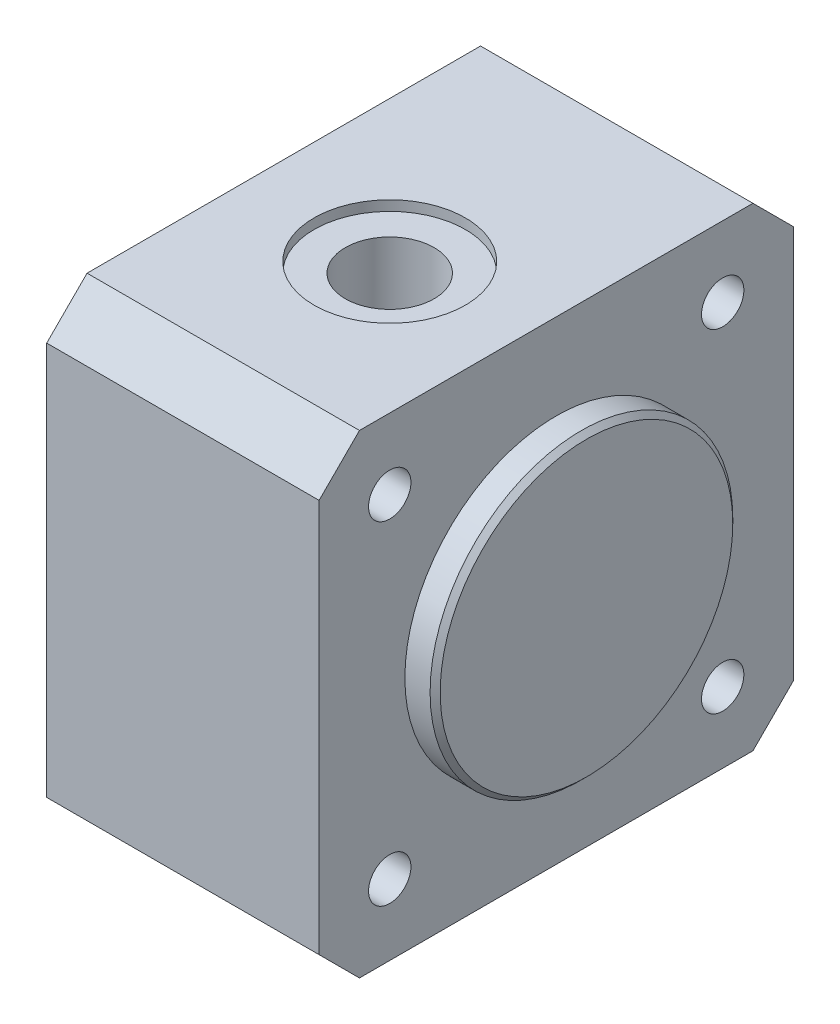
ISO-10303-21;
HEADER;
FILE_DESCRIPTION(('STEP AP214'),'2;1');
FILE_NAME('part.step','',(''),(''),'','','');
FILE_SCHEMA(('AUTOMOTIVE_DESIGN { 1 0 10303 214 1 1 1 1 }'));
ENDSEC;
DATA;
#1=APPLICATION_CONTEXT('core data for automotive mechanical design processes');
#2=APPLICATION_PROTOCOL_DEFINITION('international standard','automotive_design',2000,#1);
#3=PRODUCT_CONTEXT('',#1,'mechanical');
#4=PRODUCT('Part','Part','',(#3));
#5=PRODUCT_RELATED_PRODUCT_CATEGORY('part','',(#4));
#6=PRODUCT_DEFINITION_FORMATION('','',#4);
#7=PRODUCT_DEFINITION_CONTEXT('part definition',#1,'design');
#8=PRODUCT_DEFINITION('design','',#6,#7);
#9=PRODUCT_DEFINITION_SHAPE('','',#8);
#10=(LENGTH_UNIT() NAMED_UNIT(*) SI_UNIT(.MILLI.,.METRE.));
#11=(NAMED_UNIT(*) PLANE_ANGLE_UNIT() SI_UNIT($,.RADIAN.));
#12=(NAMED_UNIT(*) SI_UNIT($,.STERADIAN.) SOLID_ANGLE_UNIT());
#13=UNCERTAINTY_MEASURE_WITH_UNIT(LENGTH_MEASURE(1.E-05),#10,'distance_accuracy_value','');
#14=(GEOMETRIC_REPRESENTATION_CONTEXT(3) GLOBAL_UNCERTAINTY_ASSIGNED_CONTEXT((#13)) GLOBAL_UNIT_ASSIGNED_CONTEXT((#10,
#11,#12)) REPRESENTATION_CONTEXT('',''));
#15=CARTESIAN_POINT('',(0.,0.,0.));
#16=DIRECTION('',(0.,0.,1.));
#17=DIRECTION('',(1.,0.,0.));
#18=AXIS2_PLACEMENT_3D('',#15,#16,#17);
#19=CARTESIAN_POINT('',(14.,47.,-20.));
#20=DIRECTION('',(0.,1.,0.));
#21=DIRECTION('',(0.,0.,1.));
#22=AXIS2_PLACEMENT_3D('',#19,#20,#21);
#23=CYLINDRICAL_SURFACE('',#22,4.39999999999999);
#24=CARTESIAN_POINT('',(14.,23.5,-20.));
#25=DIRECTION('',(0.,1.,0.));
#26=DIRECTION('',(0.,0.,1.));
#27=AXIS2_PLACEMENT_3D('',#24,#25,#26);
#28=CIRCLE('',#27,4.4);
#29=CARTESIAN_POINT('',(12.1669697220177,23.5,-16.));
#30=VERTEX_POINT('',#29);
#31=CARTESIAN_POINT('',(15.8330302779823,23.5,-16.));
#32=VERTEX_POINT('',#31);
#33=EDGE_CURVE('E59',#30,#32,#28,.T.);
#34=ORIENTED_EDGE('',*,*,#33,.F.);
#35=CARTESIAN_POINT('',(15.8330302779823,23.5,-16.));
#36=CARTESIAN_POINT('',(15.8330136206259,23.5649652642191,-15.9999975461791));
#37=CARTESIAN_POINT('',(15.8348737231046,23.6299119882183,-16.0008443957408));
#38=CARTESIAN_POINT('',(15.8422002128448,23.7595219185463,-16.0042117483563));
#39=CARTESIAN_POINT('',(15.8476645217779,23.8241852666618,-16.0067312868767));
#40=CARTESIAN_POINT('',(15.8691678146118,24.0167886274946,-16.0167264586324));
#41=CARTESIAN_POINT('',(15.8903203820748,24.1440566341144,-16.0266392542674));
#42=CARTESIAN_POINT('',(15.9434320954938,24.393334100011,-16.0523543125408));
#43=CARTESIAN_POINT('',(15.9752038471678,24.5153959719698,-16.0680549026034));
#44=CARTESIAN_POINT('',(16.0470431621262,24.7563497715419,-16.1049706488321));
#45=CARTESIAN_POINT('',(16.0871235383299,24.8752364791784,-16.1261943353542));
#46=CARTESIAN_POINT('',(16.202132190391,25.1886952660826,-16.1898398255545));
#47=CARTESIAN_POINT('',(16.2823605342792,25.3803607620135,-16.236915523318));
#48=CARTESIAN_POINT('',(16.4512273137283,25.7559170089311,-16.344651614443));
#49=CARTESIAN_POINT('',(16.5398693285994,25.9398044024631,-16.4053178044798));
#50=CARTESIAN_POINT('',(16.7215113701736,26.3030156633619,-16.5407559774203));
#51=CARTESIAN_POINT('',(16.8145498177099,26.4822626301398,-16.6156822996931));
#52=CARTESIAN_POINT('',(17.0003191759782,26.8344890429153,-16.7792212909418));
#53=CARTESIAN_POINT('',(17.0930501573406,27.0074700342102,-16.8678305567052));
#54=CARTESIAN_POINT('',(17.284177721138,27.3637132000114,-17.0682492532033));
#55=CARTESIAN_POINT('',(17.3822569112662,27.5463555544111,-17.1814726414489));
#56=CARTESIAN_POINT('',(17.5712935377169,27.9037969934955,-17.4251855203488));
#57=CARTESIAN_POINT('',(17.6622486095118,28.0785934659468,-17.5556807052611));
#58=CARTESIAN_POINT('',(17.8330855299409,28.4181475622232,-17.8334660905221));
#59=CARTESIAN_POINT('',(17.9130315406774,28.5829599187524,-17.9806489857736));
#60=CARTESIAN_POINT('',(18.0587626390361,28.9018653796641,-18.2923552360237));
#61=CARTESIAN_POINT('',(18.1245603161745,29.0559679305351,-18.4568629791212));
#62=CARTESIAN_POINT('',(18.2465112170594,29.3737736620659,-18.8291204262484));
#63=CARTESIAN_POINT('',(18.2997265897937,29.5354362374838,-19.0396527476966));
#64=CARTESIAN_POINT('',(18.3561363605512,29.7620261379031,-19.3702328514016));
#65=CARTESIAN_POINT('',(18.3710388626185,29.8349353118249,-19.4829450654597));
#66=CARTESIAN_POINT('',(18.392123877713,29.9749094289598,-19.7127050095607));
#67=CARTESIAN_POINT('',(18.398310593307,30.0419771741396,-19.8297506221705));
#68=CARTESIAN_POINT('',(18.4011022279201,30.1703799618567,-20.068586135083));
#69=CARTESIAN_POINT('',(18.3976106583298,30.2316509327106,-20.1904117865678));
#70=CARTESIAN_POINT('',(18.3800223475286,30.3471993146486,-20.4366119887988));
#71=CARTESIAN_POINT('',(18.3659255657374,30.4014766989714,-20.5609865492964));
#72=CARTESIAN_POINT('',(18.3264876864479,30.5026177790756,-20.8108559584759));
#73=CARTESIAN_POINT('',(18.3011557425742,30.5494874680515,-20.9363498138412));
#74=CARTESIAN_POINT('',(18.2388237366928,30.6356665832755,-21.1870320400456));
#75=CARTESIAN_POINT('',(18.2018255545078,30.674977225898,-21.3122204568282));
#76=CARTESIAN_POINT('',(18.1219184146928,30.7411921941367,-21.543582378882));
#77=CARTESIAN_POINT('',(18.0805197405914,30.7690589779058,-21.6500054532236));
#78=CARTESIAN_POINT('',(17.9890126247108,30.8193759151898,-21.8603574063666));
#79=CARTESIAN_POINT('',(17.9389046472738,30.841826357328,-21.9642864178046));
#80=CARTESIAN_POINT('',(17.8302089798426,30.8816156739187,-22.1686149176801));
#81=CARTESIAN_POINT('',(17.7716218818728,30.8989549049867,-22.269014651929));
#82=CARTESIAN_POINT('',(17.6463222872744,30.928952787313,-22.4653389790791));
#83=CARTESIAN_POINT('',(17.5796097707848,30.9416114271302,-22.5612635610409));
#84=CARTESIAN_POINT('',(17.4422417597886,30.962213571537,-22.7428517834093));
#85=CARTESIAN_POINT('',(17.3719805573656,30.9703707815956,-22.8287897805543));
#86=CARTESIAN_POINT('',(17.2250275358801,30.9834623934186,-22.9952538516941));
#87=CARTESIAN_POINT('',(17.148333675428,30.9883957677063,-23.0757781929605));
#88=CARTESIAN_POINT('',(16.9093477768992,30.9991543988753,-23.3083212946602));
#89=CARTESIAN_POINT('',(16.7380438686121,31.0009524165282,-23.451452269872));
#90=CARTESIAN_POINT('',(16.3652576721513,30.9980962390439,-23.7176827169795));
#91=CARTESIAN_POINT('',(16.1625928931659,30.9930562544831,-23.8391084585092));
#92=CARTESIAN_POINT('',(15.7403551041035,30.9806867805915,-24.0480327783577));
#93=CARTESIAN_POINT('',(15.5207780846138,30.9733567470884,-24.1355232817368));
#94=CARTESIAN_POINT('',(15.1778776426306,30.9633695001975,-24.2412127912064));
#95=CARTESIAN_POINT('',(15.0584687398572,30.9601484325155,-24.2725737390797));
#96=CARTESIAN_POINT('',(14.817432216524,30.9545172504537,-24.3251582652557));
#97=CARTESIAN_POINT('',(14.6958053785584,30.9521068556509,-24.3463853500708));
#98=CARTESIAN_POINT('',(14.4511487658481,30.9483830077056,-24.3785499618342));
#99=CARTESIAN_POINT('',(14.3281185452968,30.9470699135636,-24.3894841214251));
#100=CARTESIAN_POINT('',(14.081611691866,30.9456889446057,-24.4009721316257));
#101=CARTESIAN_POINT('',(13.9581352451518,30.945620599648,-24.401529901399));
#102=CARTESIAN_POINT('',(13.7117721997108,30.9467350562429,-24.3922769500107));
#103=CARTESIAN_POINT('',(13.5888849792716,30.9479158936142,-24.3824825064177));
#104=CARTESIAN_POINT('',(13.3444253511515,30.9513924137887,-24.3526290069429));
#105=CARTESIAN_POINT('',(13.2228524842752,30.9536876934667,-24.332573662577));
#106=CARTESIAN_POINT('',(12.9817749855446,30.9591280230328,-24.2823342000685));
#107=CARTESIAN_POINT('',(12.8622714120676,30.9622734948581,-24.2521450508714));
#108=CARTESIAN_POINT('',(12.6262723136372,30.9690226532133,-24.1818686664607));
#109=CARTESIAN_POINT('',(12.509775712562,30.9726261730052,-24.1417850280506));
#110=CARTESIAN_POINT('',(12.2802966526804,30.9798027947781,-24.0518933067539));
#111=CARTESIAN_POINT('',(12.1673225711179,30.9833758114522,-24.0020638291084));
#112=CARTESIAN_POINT('',(11.9459870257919,30.9898896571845,-23.8931016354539));
#113=CARTESIAN_POINT('',(11.8376238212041,30.9928307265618,-23.8339724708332));
#114=CARTESIAN_POINT('',(11.6261740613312,30.9974191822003,-23.7067748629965));
#115=CARTESIAN_POINT('',(11.523090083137,30.9990659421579,-23.6387021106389));
#116=CARTESIAN_POINT('',(11.3230396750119,31.0003456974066,-23.4941529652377));
#117=CARTESIAN_POINT('',(11.2260707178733,30.9999795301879,-23.4176800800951));
#118=CARTESIAN_POINT('',(11.0392420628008,30.9964955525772,-23.2571504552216));
#119=CARTESIAN_POINT('',(10.9493595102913,30.9933870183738,-23.1731201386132));
#120=CARTESIAN_POINT('',(10.7770679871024,30.9836921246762,-22.9979646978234));
#121=CARTESIAN_POINT('',(10.6946558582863,30.9771072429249,-22.9068426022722));
#122=CARTESIAN_POINT('',(10.5379344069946,30.9597515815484,-22.7182943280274));
#123=CARTESIAN_POINT('',(10.4636223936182,30.9489821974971,-22.6208702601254));
#124=CARTESIAN_POINT('',(10.3236489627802,30.9226084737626,-22.4206122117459));
#125=CARTESIAN_POINT('',(10.2579869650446,30.9070044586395,-22.3177785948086));
#126=CARTESIAN_POINT('',(10.1393909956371,30.8714935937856,-22.1139467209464));
#127=CARTESIAN_POINT('',(10.0859345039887,30.8518950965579,-22.0131984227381));
#128=CARTESIAN_POINT('',(9.98737407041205,30.8075801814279,-21.8087857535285));
#129=CARTESIAN_POINT('',(9.94226977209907,30.7828639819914,-21.7051215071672));
#130=CARTESIAN_POINT('',(9.86056975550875,30.7280900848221,-21.4959033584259));
#131=CARTESIAN_POINT('',(9.82397189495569,30.6980337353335,-21.3903499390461));
#132=CARTESIAN_POINT('',(9.75926872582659,30.6324749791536,-21.178338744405));
#133=CARTESIAN_POINT('',(9.7311633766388,30.5969725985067,-21.0718809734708));
#134=CARTESIAN_POINT('',(9.68426532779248,30.5221006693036,-20.8633593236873));
#135=CARTESIAN_POINT('',(9.66514133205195,30.4829461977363,-20.761292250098));
#136=CARTESIAN_POINT('',(9.63431339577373,30.3997578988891,-20.5579923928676));
#137=CARTESIAN_POINT('',(9.62261216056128,30.3557222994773,-20.4567599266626));
#138=CARTESIAN_POINT('',(9.60629083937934,30.2629824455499,-20.2558812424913));
#139=CARTESIAN_POINT('',(9.60167084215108,30.2142781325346,-20.1562350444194));
#140=CARTESIAN_POINT('',(9.59908538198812,30.1124541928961,-19.9591294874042));
#141=CARTESIAN_POINT('',(9.60112122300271,30.0593337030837,-19.8616705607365));
#142=CARTESIAN_POINT('',(9.61305007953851,29.9309853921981,-19.6381359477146));
#143=CARTESIAN_POINT('',(9.62528601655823,29.8541918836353,-19.5130772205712));
#144=CARTESIAN_POINT('',(9.6594567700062,29.6940867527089,-19.2686076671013));
#145=CARTESIAN_POINT('',(9.68139416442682,29.6107734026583,-19.1491983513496));
#146=CARTESIAN_POINT('',(9.76004506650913,29.3519243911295,-18.8001243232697));
#147=CARTESIAN_POINT('',(9.82958452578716,29.1675839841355,-18.5797935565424));
#148=CARTESIAN_POINT('',(10.0251250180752,28.7073387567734,-18.0883292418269));
#149=CARTESIAN_POINT('',(10.1625349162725,28.4231926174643,-17.8295483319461));
#150=CARTESIAN_POINT('',(10.3900667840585,27.9779141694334,-17.4805268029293));
#151=CARTESIAN_POINT('',(10.4696132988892,27.826073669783,-17.3705783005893));
#152=CARTESIAN_POINT('',(10.6337973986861,27.5165321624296,-17.1634308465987));
#153=CARTESIAN_POINT('',(10.7184340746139,27.3588322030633,-17.066229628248));
#154=CARTESIAN_POINT('',(10.8939256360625,27.0317582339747,-16.8808310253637));
#155=CARTESIAN_POINT('',(10.9848944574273,26.8621685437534,-16.7931250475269));
#156=CARTESIAN_POINT('',(11.1673194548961,26.51693834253,-16.6309037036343));
#157=CARTESIAN_POINT('',(11.2587758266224,26.341295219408,-16.5563941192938));
#158=CARTESIAN_POINT('',(11.4386598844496,25.9836372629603,-16.4205857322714));
#159=CARTESIAN_POINT('',(11.5270900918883,25.8016280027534,-16.3592756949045));
#160=CARTESIAN_POINT('',(11.696075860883,25.430263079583,-16.2500642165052));
#161=CARTESIAN_POINT('',(11.776638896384,25.2409146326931,-16.2021499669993));
#162=CARTESIAN_POINT('',(11.9260107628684,24.8438926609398,-16.1184753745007));
#163=CARTESIAN_POINT('',(11.9940865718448,24.6357760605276,-16.0833943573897));
#164=CARTESIAN_POINT('',(12.0738943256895,24.3169561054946,-16.0438634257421));
#165=CARTESIAN_POINT('',(12.0967493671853,24.2098545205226,-16.0328796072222));
#166=CARTESIAN_POINT('',(12.1334273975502,23.9937798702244,-16.0154895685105));
#167=CARTESIAN_POINT('',(12.1472589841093,23.8848086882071,-16.0090789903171));
#168=CARTESIAN_POINT('',(12.159616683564,23.7296361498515,-16.0033761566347));
#169=CARTESIAN_POINT('',(12.1623655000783,23.6838132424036,-16.0021124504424));
#170=CARTESIAN_POINT('',(12.1660451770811,23.5919963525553,-16.0004234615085));
#171=CARTESIAN_POINT('',(12.1669727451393,23.5460022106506,-15.9999996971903));
#172=CARTESIAN_POINT('',(12.1669697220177,23.5,-16.));
#173=B_SPLINE_CURVE_WITH_KNOTS('',3,(#35,#36,#37,#38,#39,#40,#41,#42,#43,#44,#45,#46,#47,#48,
#49,#50,#51,#52,#53,#54,#55,#56,#57,#58,#59,#60,#61,#62,#63,#64,#65,#66,#67,#68,#69,#70,#71,#72,
#73,#74,#75,#76,#77,#78,#79,#80,#81,#82,#83,#84,#85,#86,#87,#88,#89,#90,#91,#92,#93,#94,#95,#96,
#97,#98,#99,#100,#101,#102,#103,#104,#105,#106,#107,#108,#109,#110,#111,#112,#113,#114,#115,
#116,#117,#118,#119,#120,#121,#122,#123,#124,#125,#126,#127,#128,#129,#130,#131,#132,#133,#134,
#135,#136,#137,#138,#139,#140,#141,#142,#143,#144,#145,#146,#147,#148,#149,#150,#151,#152,#153,
#154,#155,#156,#157,#158,#159,#160,#161,#162,#163,#164,#165,#166,#167,#168,#169,#170,#171,#172),
.UNSPECIFIED.,.F.,.F.,(4,2,2,2,2,2,2,2,2,2,2,2,2,2,2,2,2,2,2,2,2,2,2,2,2,2,2,2,2,2,2,2,2,2,2,2,
2,2,2,2,2,2,2,2,2,2,2,2,2,2,2,2,2,2,2,2,2,2,2,2,2,2,2,2,2,2,2,2,4),(0.,0.194829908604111,
0.389547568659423,0.776853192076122,1.15765632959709,1.53905114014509,2.1771047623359,
2.81543104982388,3.46110541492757,4.10661944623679,4.8144566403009,5.52252778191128,
6.22627969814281,6.92940278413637,7.738251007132,8.14304762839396,8.54764899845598,
8.95629854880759,9.36494966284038,9.77326844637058,10.1815214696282,10.5336890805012,
10.8858379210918,11.2379621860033,11.5900873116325,11.9236164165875,12.257251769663,
12.9239921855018,13.6299552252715,14.3360861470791,14.7062218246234,15.0762293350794,
15.4463578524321,15.8163465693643,16.1857543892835,16.5550286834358,16.9244865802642,
17.2938103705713,17.6639542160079,18.0339570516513,18.4041388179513,18.7741665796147,
19.1429474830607,19.5115717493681,19.8800731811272,20.248549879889,20.595276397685,
20.9419881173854,21.2886124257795,21.6352350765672,21.9678080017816,22.300502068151,
22.633200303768,22.9659637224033,23.4070981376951,23.8483498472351,24.7314703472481,
25.9489768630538,26.5595317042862,27.1699778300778,27.803951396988,28.4382020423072,
29.0719106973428,29.7050113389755,30.3679531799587,30.6977597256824,31.0272515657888,
31.1649825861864,31.3029623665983),.UNSPECIFIED.);
#174=EDGE_CURVE('E11',#32,#30,#173,.T.);
#175=ORIENTED_EDGE('',*,*,#174,.F.);
#176=EDGE_LOOP('',(#34,#175));
#177=FACE_BOUND('',#176,.T.);
#178=CARTESIAN_POINT('',(14.,46.,-20.));
#179=DIRECTION('',(0.,1.,0.));
#180=DIRECTION('',(0.,0.,1.));
#181=AXIS2_PLACEMENT_3D('',#178,#179,#180);
#182=CIRCLE('',#181,4.39999999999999);
#183=CARTESIAN_POINT('',(14.,46.,-15.6));
#184=VERTEX_POINT('',#183);
#185=EDGE_CURVE('E48',#184,#184,#182,.F.);
#186=ORIENTED_EDGE('',*,*,#185,.F.);
#187=EDGE_LOOP('',(#186));
#188=FACE_BOUND('',#187,.T.);
#189=ADVANCED_FACE('F44',(#177,#188),#23,.F.);
#190=CARTESIAN_POINT('',(-7.,23.5,-23.5));
#191=DIRECTION('',(1.,0.,0.));
#192=DIRECTION('',(0.,0.,-1.));
#193=AXIS2_PLACEMENT_3D('',#190,#191,#192);
#194=CYLINDRICAL_SURFACE('',#193,16.5);
#195=CARTESIAN_POINT('',(0.,23.5,-23.5));
#196=DIRECTION('',(-1.,0.,0.));
#197=DIRECTION('',(0.,0.,1.));
#198=AXIS2_PLACEMENT_3D('',#195,#196,#197);
#199=CIRCLE('',#198,16.5);
#200=CARTESIAN_POINT('',(0.,23.5,-7.));
#201=VERTEX_POINT('',#200);
#202=EDGE_CURVE('E146',#201,#201,#199,.T.);
#203=ORIENTED_EDGE('',*,*,#202,.T.);
#204=EDGE_LOOP('',(#203));
#205=FACE_BOUND('',#204,.T.);
#206=CARTESIAN_POINT('',(-2.39222561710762,23.5,-23.5));
#207=DIRECTION('',(-1.,0.,0.));
#208=DIRECTION('',(0.,0.,1.));
#209=AXIS2_PLACEMENT_3D('',#206,#207,#208);
#210=CIRCLE('',#209,16.5);
#211=CARTESIAN_POINT('',(-2.39222561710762,23.5,-7.));
#212=VERTEX_POINT('',#211);
#213=EDGE_CURVE('E149',#212,#212,#210,.T.);
#214=ORIENTED_EDGE('',*,*,#213,.F.);
#215=EDGE_LOOP('',(#214));
#216=FACE_BOUND('',#215,.T.);
#217=ADVANCED_FACE('F256',(#205,#216),#194,.T.);
#218=CARTESIAN_POINT('',(0.,47.,0.));
#219=DIRECTION('',(-1.,0.,0.));
#220=DIRECTION('',(0.,0.,1.));
#221=AXIS2_PLACEMENT_3D('',#218,#219,#220);
#222=PLANE('',#221);
#223=CARTESIAN_POINT('',(0.,40.,-40.));
#224=DIRECTION('',(1.,0.,0.));
#225=DIRECTION('',(0.,0.,-1.));
#226=AXIS2_PLACEMENT_3D('',#223,#224,#225);
#227=CIRCLE('',#226,2.09999999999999);
#228=CARTESIAN_POINT('',(0.,40.,-42.1));
#229=VERTEX_POINT('',#228);
#230=EDGE_CURVE('E224',#229,#229,#227,.T.);
#231=ORIENTED_EDGE('',*,*,#230,.T.);
#232=EDGE_LOOP('',(#231));
#233=FACE_BOUND('',#232,.T.);
#234=CARTESIAN_POINT('',(0.,40.,-6.99999999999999));
#235=DIRECTION('',(1.,0.,0.));
#236=DIRECTION('',(0.,0.,-1.));
#237=AXIS2_PLACEMENT_3D('',#234,#235,#236);
#238=CIRCLE('',#237,2.09999999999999);
#239=CARTESIAN_POINT('',(0.,40.,-9.09999999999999));
#240=VERTEX_POINT('',#239);
#241=EDGE_CURVE('E218',#240,#240,#238,.T.);
#242=ORIENTED_EDGE('',*,*,#241,.T.);
#243=EDGE_LOOP('',(#242));
#244=FACE_BOUND('',#243,.T.);
#245=CARTESIAN_POINT('',(0.,7.,-7.));
#246=DIRECTION('',(1.,0.,0.));
#247=DIRECTION('',(0.,0.,-1.));
#248=AXIS2_PLACEMENT_3D('',#245,#246,#247);
#249=CIRCLE('',#248,2.09999999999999);
#250=CARTESIAN_POINT('',(0.,7.,-9.09999999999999));
#251=VERTEX_POINT('',#250);
#252=EDGE_CURVE('E155',#251,#251,#249,.T.);
#253=ORIENTED_EDGE('',*,*,#252,.T.);
#254=EDGE_LOOP('',(#253));
#255=FACE_BOUND('',#254,.T.);
#256=DIRECTION('',(0.,1.,0.));
#257=VECTOR('',#256,1.);
#258=CARTESIAN_POINT('',(0.,0.,-47.));
#259=LINE('',#258,#257);
#260=CARTESIAN_POINT('',(0.,4.00000000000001,-47.));
#261=VERTEX_POINT('',#260);
#262=CARTESIAN_POINT('',(0.,43.,-47.));
#263=VERTEX_POINT('',#262);
#264=EDGE_CURVE('E180',#261,#263,#259,.T.);
#265=ORIENTED_EDGE('',*,*,#264,.F.);
#266=DIRECTION('',(0.,0.707106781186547,-0.707106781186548));
#267=VECTOR('',#266,1.);
#268=CARTESIAN_POINT('',(0.,1.99999999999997,-44.9999999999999));
#269=LINE('',#268,#267);
#270=CARTESIAN_POINT('',(0.,0.,-43.));
#271=VERTEX_POINT('',#270);
#272=EDGE_CURVE('E194',#261,#271,#269,.F.);
#273=ORIENTED_EDGE('',*,*,#272,.T.);
#274=DIRECTION('',(0.,0.,-1.));
#275=VECTOR('',#274,1.);
#276=CARTESIAN_POINT('',(0.,0.,0.));
#277=LINE('',#276,#275);
#278=CARTESIAN_POINT('',(0.,0.,-4.));
#279=VERTEX_POINT('',#278);
#280=EDGE_CURVE('E177',#279,#271,#277,.T.);
#281=ORIENTED_EDGE('',*,*,#280,.F.);
#282=DIRECTION('',(0.,-0.707106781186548,-0.707106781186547));
#283=VECTOR('',#282,1.);
#284=CARTESIAN_POINT('',(0.,25.5,21.5));
#285=LINE('',#284,#283);
#286=CARTESIAN_POINT('',(0.,4.00000000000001,0.));
#287=VERTEX_POINT('',#286);
#288=EDGE_CURVE('E192',#279,#287,#285,.F.);
#289=ORIENTED_EDGE('',*,*,#288,.T.);
#290=DIRECTION('',(0.,-1.,0.));
#291=VECTOR('',#290,1.);
#292=CARTESIAN_POINT('',(0.,0.,0.));
#293=LINE('',#292,#291);
#294=CARTESIAN_POINT('',(0.,43.,0.));
#295=VERTEX_POINT('',#294);
#296=EDGE_CURVE('E161',#295,#287,#293,.T.);
#297=ORIENTED_EDGE('',*,*,#296,.F.);
#298=DIRECTION('',(0.,-0.707106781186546,0.707106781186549));
#299=VECTOR('',#298,1.);
#300=CARTESIAN_POINT('',(0.,45.,-1.99999999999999));
#301=LINE('',#300,#299);
#302=CARTESIAN_POINT('',(0.,47.,-4.));
#303=VERTEX_POINT('',#302);
#304=EDGE_CURVE('E188',#295,#303,#301,.F.);
#305=ORIENTED_EDGE('',*,*,#304,.T.);
#306=DIRECTION('',(0.,0.,1.));
#307=VECTOR('',#306,1.);
#308=CARTESIAN_POINT('',(0.,47.,0.));
#309=LINE('',#308,#307);
#310=CARTESIAN_POINT('',(0.,47.,-43.));
#311=VERTEX_POINT('',#310);
#312=EDGE_CURVE('E166',#311,#303,#309,.T.);
#313=ORIENTED_EDGE('',*,*,#312,.F.);
#314=DIRECTION('',(0.,0.707106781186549,0.707106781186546));
#315=VECTOR('',#314,1.);
#316=CARTESIAN_POINT('',(0.,68.5,-21.5000000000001));
#317=LINE('',#316,#315);
#318=EDGE_CURVE('E190',#311,#263,#317,.F.);
#319=ORIENTED_EDGE('',*,*,#318,.T.);
#320=EDGE_LOOP('',(#265,#273,#281,#289,#297,#305,#313,#319));
#321=FACE_BOUND('',#320,.T.);
#322=CARTESIAN_POINT('',(0.,7.00000000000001,-40.));
#323=DIRECTION('',(1.,0.,0.));
#324=DIRECTION('',(0.,0.,-1.));
#325=AXIS2_PLACEMENT_3D('',#322,#323,#324);
#326=CIRCLE('',#325,2.09999999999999);
#327=CARTESIAN_POINT('',(0.,7.00000000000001,-42.1));
#328=VERTEX_POINT('',#327);
#329=EDGE_CURVE('E145',#328,#328,#326,.T.);
#330=ORIENTED_EDGE('',*,*,#329,.T.);
#331=EDGE_LOOP('',(#330));
#332=FACE_BOUND('',#331,.T.);
#333=ORIENTED_EDGE('',*,*,#202,.F.);
#334=EDGE_LOOP('',(#333));
#335=FACE_BOUND('',#334,.T.);
#336=ADVANCED_FACE('F259',(#233,#244,#255,#321,#332,#335),#222,.T.);
#337=CARTESIAN_POINT('',(27.,47.,0.));
#338=DIRECTION('',(-1.,0.,0.));
#339=DIRECTION('',(0.,0.,1.));
#340=AXIS2_PLACEMENT_3D('',#337,#338,#339);
#341=PLANE('',#340);
#342=CARTESIAN_POINT('',(27.,40.,-40.));
#343=DIRECTION('',(1.,0.,0.));
#344=DIRECTION('',(0.,0.,-1.));
#345=AXIS2_PLACEMENT_3D('',#342,#343,#344);
#346=CIRCLE('',#345,2.1);
#347=CARTESIAN_POINT('',(27.,40.,-42.1));
#348=VERTEX_POINT('',#347);
#349=EDGE_CURVE('E227',#348,#348,#346,.T.);
#350=ORIENTED_EDGE('',*,*,#349,.F.);
#351=EDGE_LOOP('',(#350));
#352=FACE_BOUND('',#351,.T.);
#353=CARTESIAN_POINT('',(27.,40.,-7.));
#354=DIRECTION('',(1.,0.,0.));
#355=DIRECTION('',(0.,0.,-1.));
#356=AXIS2_PLACEMENT_3D('',#353,#354,#355);
#357=CIRCLE('',#356,2.1);
#358=CARTESIAN_POINT('',(27.,40.,-9.1));
#359=VERTEX_POINT('',#358);
#360=EDGE_CURVE('E221',#359,#359,#357,.T.);
#361=ORIENTED_EDGE('',*,*,#360,.F.);
#362=EDGE_LOOP('',(#361));
#363=FACE_BOUND('',#362,.T.);
#364=DIRECTION('',(0.,0.,-1.));
#365=VECTOR('',#364,1.);
#366=CARTESIAN_POINT('',(27.,0.,0.));
#367=LINE('',#366,#365);
#368=CARTESIAN_POINT('',(27.,0.,-4.));
#369=VERTEX_POINT('',#368);
#370=CARTESIAN_POINT('',(27.,0.,-43.));
#371=VERTEX_POINT('',#370);
#372=EDGE_CURVE('E165',#369,#371,#367,.T.);
#373=ORIENTED_EDGE('',*,*,#372,.T.);
#374=DIRECTION('',(0.,-0.707106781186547,0.707106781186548));
#375=VECTOR('',#374,1.);
#376=CARTESIAN_POINT('',(27.,4.00000000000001,-47.));
#377=LINE('',#376,#375);
#378=CARTESIAN_POINT('',(27.,4.00000000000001,-47.));
#379=VERTEX_POINT('',#378);
#380=EDGE_CURVE('E207',#371,#379,#377,.F.);
#381=ORIENTED_EDGE('',*,*,#380,.T.);
#382=DIRECTION('',(0.,1.,0.));
#383=VECTOR('',#382,1.);
#384=CARTESIAN_POINT('',(27.,0.,-47.));
#385=LINE('',#384,#383);
#386=CARTESIAN_POINT('',(27.,43.,-47.));
#387=VERTEX_POINT('',#386);
#388=EDGE_CURVE('E169',#379,#387,#385,.T.);
#389=ORIENTED_EDGE('',*,*,#388,.T.);
#390=DIRECTION('',(0.,-0.707106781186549,-0.707106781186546));
#391=VECTOR('',#390,1.);
#392=CARTESIAN_POINT('',(27.,47.,-43.));
#393=LINE('',#392,#391);
#394=CARTESIAN_POINT('',(27.,47.,-43.));
#395=VERTEX_POINT('',#394);
#396=EDGE_CURVE('E203',#387,#395,#393,.F.);
#397=ORIENTED_EDGE('',*,*,#396,.T.);
#398=DIRECTION('',(0.,0.,1.));
#399=VECTOR('',#398,1.);
#400=CARTESIAN_POINT('',(27.,47.,0.));
#401=LINE('',#400,#399);
#402=CARTESIAN_POINT('',(27.,47.,-4.));
#403=VERTEX_POINT('',#402);
#404=EDGE_CURVE('E172',#395,#403,#401,.T.);
#405=ORIENTED_EDGE('',*,*,#404,.T.);
#406=DIRECTION('',(0.,0.707106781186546,-0.707106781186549));
#407=VECTOR('',#406,1.);
#408=CARTESIAN_POINT('',(27.,43.,0.));
#409=LINE('',#408,#407);
#410=CARTESIAN_POINT('',(27.,43.,0.));
#411=VERTEX_POINT('',#410);
#412=EDGE_CURVE('E201',#403,#411,#409,.F.);
#413=ORIENTED_EDGE('',*,*,#412,.T.);
#414=DIRECTION('',(0.,-1.,0.));
#415=VECTOR('',#414,1.);
#416=CARTESIAN_POINT('',(27.,0.,0.));
#417=LINE('',#416,#415);
#418=CARTESIAN_POINT('',(27.,4.00000000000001,0.));
#419=VERTEX_POINT('',#418);
#420=EDGE_CURVE('E162',#411,#419,#417,.T.);
#421=ORIENTED_EDGE('',*,*,#420,.T.);
#422=DIRECTION('',(0.,0.707106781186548,0.707106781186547));
#423=VECTOR('',#422,1.);
#424=CARTESIAN_POINT('',(27.,0.,-4.));
#425=LINE('',#424,#423);
#426=EDGE_CURVE('E205',#419,#369,#425,.F.);
#427=ORIENTED_EDGE('',*,*,#426,.T.);
#428=EDGE_LOOP('',(#373,#381,#389,#397,#405,#413,#421,#427));
#429=FACE_BOUND('',#428,.T.);
#430=CARTESIAN_POINT('',(27.,7.,-7.00000000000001));
#431=DIRECTION('',(1.,0.,0.));
#432=DIRECTION('',(0.,0.,-1.));
#433=AXIS2_PLACEMENT_3D('',#430,#431,#432);
#434=CIRCLE('',#433,2.1);
#435=CARTESIAN_POINT('',(27.,7.,-9.1));
#436=VERTEX_POINT('',#435);
#437=EDGE_CURVE('E158',#436,#436,#434,.T.);
#438=ORIENTED_EDGE('',*,*,#437,.F.);
#439=EDGE_LOOP('',(#438));
#440=FACE_BOUND('',#439,.T.);
#441=CARTESIAN_POINT('',(27.,7.00000000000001,-40.));
#442=DIRECTION('',(1.,0.,0.));
#443=DIRECTION('',(0.,0.,-1.));
#444=AXIS2_PLACEMENT_3D('',#441,#442,#443);
#445=CIRCLE('',#444,2.1);
#446=CARTESIAN_POINT('',(27.,7.00000000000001,-42.1));
#447=VERTEX_POINT('',#446);
#448=EDGE_CURVE('E152',#447,#447,#445,.T.);
#449=ORIENTED_EDGE('',*,*,#448,.F.);
#450=EDGE_LOOP('',(#449));
#451=FACE_BOUND('',#450,.T.);
#452=CARTESIAN_POINT('',(27.,23.5,-23.5));
#453=DIRECTION('',(-1.,0.,0.));
#454=DIRECTION('',(0.,0.,1.));
#455=AXIS2_PLACEMENT_3D('',#452,#453,#454);
#456=CIRCLE('',#455,15.);
#457=CARTESIAN_POINT('',(27.,23.5,-8.5));
#458=VERTEX_POINT('',#457);
#459=EDGE_CURVE('E230',#458,#458,#456,.F.);
#460=ORIENTED_EDGE('',*,*,#459,.F.);
#461=EDGE_LOOP('',(#460));
#462=FACE_BOUND('',#461,.T.);
#463=ADVANCED_FACE('F280',(#352,#363,#429,#440,#451,#462),#341,.F.);
#464=CARTESIAN_POINT('',(27.,0.,0.));
#465=DIRECTION('',(0.,0.,-1.));
#466=DIRECTION('',(-1.,0.,0.));
#467=AXIS2_PLACEMENT_3D('',#464,#465,#466);
#468=PLANE('',#467);
#469=ORIENTED_EDGE('',*,*,#296,.T.);
#470=DIRECTION('',(1.,0.,0.));
#471=VECTOR('',#470,1.);
#472=CARTESIAN_POINT('',(27.,4.00000000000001,0.));
#473=LINE('',#472,#471);
#474=EDGE_CURVE('E212',#287,#419,#473,.T.);
#475=ORIENTED_EDGE('',*,*,#474,.T.);
#476=ORIENTED_EDGE('',*,*,#420,.F.);
#477=DIRECTION('',(-1.,0.,0.));
#478=VECTOR('',#477,1.);
#479=CARTESIAN_POINT('',(27.,43.,0.));
#480=LINE('',#479,#478);
#481=EDGE_CURVE('E209',#411,#295,#480,.T.);
#482=ORIENTED_EDGE('',*,*,#481,.T.);
#483=EDGE_LOOP('',(#469,#475,#476,#482));
#484=FACE_BOUND('',#483,.T.);
#485=ADVANCED_FACE('F283',(#484),#468,.F.);
#486=CARTESIAN_POINT('',(27.,0.,0.));
#487=DIRECTION('',(0.,1.,0.));
#488=DIRECTION('',(0.,0.,1.));
#489=AXIS2_PLACEMENT_3D('',#486,#487,#488);
#490=PLANE('',#489);
#491=ORIENTED_EDGE('',*,*,#280,.T.);
#492=DIRECTION('',(1.,0.,0.));
#493=VECTOR('',#492,1.);
#494=CARTESIAN_POINT('',(27.,0.,-43.));
#495=LINE('',#494,#493);
#496=EDGE_CURVE('E199',#271,#371,#495,.T.);
#497=ORIENTED_EDGE('',*,*,#496,.T.);
#498=ORIENTED_EDGE('',*,*,#372,.F.);
#499=DIRECTION('',(-1.,0.,0.));
#500=VECTOR('',#499,1.);
#501=CARTESIAN_POINT('',(27.,0.,-4.));
#502=LINE('',#501,#500);
#503=EDGE_CURVE('E196',#369,#279,#502,.T.);
#504=ORIENTED_EDGE('',*,*,#503,.T.);
#505=EDGE_LOOP('',(#491,#497,#498,#504));
#506=FACE_BOUND('',#505,.T.);
#507=ADVANCED_FACE('F296',(#506),#490,.F.);
#508=CARTESIAN_POINT('',(27.,0.,-47.));
#509=DIRECTION('',(0.,0.,1.));
#510=DIRECTION('',(1.,0.,0.));
#511=AXIS2_PLACEMENT_3D('',#508,#509,#510);
#512=PLANE('',#511);
#513=ORIENTED_EDGE('',*,*,#388,.F.);
#514=DIRECTION('',(-1.,0.,0.));
#515=VECTOR('',#514,1.);
#516=CARTESIAN_POINT('',(27.,4.00000000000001,-47.));
#517=LINE('',#516,#515);
#518=EDGE_CURVE('E185',#379,#261,#517,.T.);
#519=ORIENTED_EDGE('',*,*,#518,.T.);
#520=ORIENTED_EDGE('',*,*,#264,.T.);
#521=DIRECTION('',(1.,0.,0.));
#522=VECTOR('',#521,1.);
#523=CARTESIAN_POINT('',(27.,43.,-47.));
#524=LINE('',#523,#522);
#525=EDGE_CURVE('E174',#263,#387,#524,.T.);
#526=ORIENTED_EDGE('',*,*,#525,.T.);
#527=EDGE_LOOP('',(#513,#519,#520,#526));
#528=FACE_BOUND('',#527,.T.);
#529=ADVANCED_FACE('F292',(#528),#512,.F.);
#530=CARTESIAN_POINT('',(27.,47.,0.));
#531=DIRECTION('',(0.,-1.,0.));
#532=DIRECTION('',(0.,0.,-1.));
#533=AXIS2_PLACEMENT_3D('',#530,#531,#532);
#534=PLANE('',#533);
#535=CARTESIAN_POINT('',(14.,47.,-20.));
#536=DIRECTION('',(0.,1.,0.));
#537=DIRECTION('',(0.,0.,1.));
#538=AXIS2_PLACEMENT_3D('',#535,#536,#537);
#539=CIRCLE('',#538,7.5);
#540=CARTESIAN_POINT('',(14.,47.,-12.5));
#541=VERTEX_POINT('',#540);
#542=EDGE_CURVE('E350',#541,#541,#539,.T.);
#543=ORIENTED_EDGE('',*,*,#542,.F.);
#544=EDGE_LOOP('',(#543));
#545=FACE_BOUND('',#544,.T.);
#546=ORIENTED_EDGE('',*,*,#404,.F.);
#547=DIRECTION('',(-1.,0.,0.));
#548=VECTOR('',#547,1.);
#549=CARTESIAN_POINT('',(27.,47.,-43.));
#550=LINE('',#549,#548);
#551=EDGE_CURVE('E215',#395,#311,#550,.T.);
#552=ORIENTED_EDGE('',*,*,#551,.T.);
#553=ORIENTED_EDGE('',*,*,#312,.T.);
#554=DIRECTION('',(1.,0.,0.));
#555=VECTOR('',#554,1.);
#556=CARTESIAN_POINT('',(27.,47.,-4.));
#557=LINE('',#556,#555);
#558=EDGE_CURVE('E67',#303,#403,#557,.T.);
#559=ORIENTED_EDGE('',*,*,#558,.T.);
#560=EDGE_LOOP('',(#546,#552,#553,#559));
#561=FACE_BOUND('',#560,.T.);
#562=ADVANCED_FACE('F288',(#545,#561),#534,.F.);
#563=CARTESIAN_POINT('',(27.,4.00000000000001,-47.));
#564=DIRECTION('',(0.,0.707106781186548,0.707106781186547));
#565=DIRECTION('',(0.,-0.707106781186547,0.707106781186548));
#566=AXIS2_PLACEMENT_3D('',#563,#564,#565);
#567=PLANE('',#566);
#568=ORIENTED_EDGE('',*,*,#380,.F.);
#569=ORIENTED_EDGE('',*,*,#496,.F.);
#570=ORIENTED_EDGE('',*,*,#272,.F.);
#571=ORIENTED_EDGE('',*,*,#518,.F.);
#572=EDGE_LOOP('',(#568,#569,#570,#571));
#573=FACE_BOUND('',#572,.T.);
#574=ADVANCED_FACE('F291',(#573),#567,.F.);
#575=CARTESIAN_POINT('',(27.,0.,-4.));
#576=DIRECTION('',(0.,0.707106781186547,-0.707106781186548));
#577=DIRECTION('',(0.,0.707106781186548,0.707106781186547));
#578=AXIS2_PLACEMENT_3D('',#575,#576,#577);
#579=PLANE('',#578);
#580=ORIENTED_EDGE('',*,*,#426,.F.);
#581=ORIENTED_EDGE('',*,*,#474,.F.);
#582=ORIENTED_EDGE('',*,*,#288,.F.);
#583=ORIENTED_EDGE('',*,*,#503,.F.);
#584=EDGE_LOOP('',(#580,#581,#582,#583));
#585=FACE_BOUND('',#584,.T.);
#586=ADVANCED_FACE('F306',(#585),#579,.F.);
#587=CARTESIAN_POINT('',(27.,47.,-43.));
#588=DIRECTION('',(0.,-0.707106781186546,0.707106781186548));
#589=DIRECTION('',(0.,-0.707106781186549,-0.707106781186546));
#590=AXIS2_PLACEMENT_3D('',#587,#588,#589);
#591=PLANE('',#590);
#592=ORIENTED_EDGE('',*,*,#396,.F.);
#593=ORIENTED_EDGE('',*,*,#525,.F.);
#594=ORIENTED_EDGE('',*,*,#318,.F.);
#595=ORIENTED_EDGE('',*,*,#551,.F.);
#596=EDGE_LOOP('',(#592,#593,#594,#595));
#597=FACE_BOUND('',#596,.T.);
#598=ADVANCED_FACE('F310',(#597),#591,.F.);
#599=CARTESIAN_POINT('',(27.,43.,0.));
#600=DIRECTION('',(0.,-0.707106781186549,-0.707106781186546));
#601=DIRECTION('',(0.,0.707106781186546,-0.707106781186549));
#602=AXIS2_PLACEMENT_3D('',#599,#600,#601);
#603=PLANE('',#602);
#604=ORIENTED_EDGE('',*,*,#412,.F.);
#605=ORIENTED_EDGE('',*,*,#558,.F.);
#606=ORIENTED_EDGE('',*,*,#304,.F.);
#607=ORIENTED_EDGE('',*,*,#481,.F.);
#608=EDGE_LOOP('',(#604,#605,#606,#607));
#609=FACE_BOUND('',#608,.T.);
#610=ADVANCED_FACE('F278',(#609),#603,.F.);
#611=CARTESIAN_POINT('',(27.,7.,-7.00000000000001));
#612=DIRECTION('',(1.,0.,0.));
#613=DIRECTION('',(0.,0.,-1.));
#614=AXIS2_PLACEMENT_3D('',#611,#612,#613);
#615=CYLINDRICAL_SURFACE('',#614,2.1);
#616=ORIENTED_EDGE('',*,*,#252,.F.);
#617=EDGE_LOOP('',(#616));
#618=FACE_BOUND('',#617,.T.);
#619=ORIENTED_EDGE('',*,*,#437,.T.);
#620=EDGE_LOOP('',(#619));
#621=FACE_BOUND('',#620,.T.);
#622=ADVANCED_FACE('F274',(#618,#621),#615,.F.);
#623=CARTESIAN_POINT('',(27.,7.00000000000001,-40.));
#624=DIRECTION('',(1.,0.,0.));
#625=DIRECTION('',(0.,0.,-1.));
#626=AXIS2_PLACEMENT_3D('',#623,#624,#625);
#627=CYLINDRICAL_SURFACE('',#626,2.1);
#628=ORIENTED_EDGE('',*,*,#329,.F.);
#629=EDGE_LOOP('',(#628));
#630=FACE_BOUND('',#629,.T.);
#631=ORIENTED_EDGE('',*,*,#448,.T.);
#632=EDGE_LOOP('',(#631));
#633=FACE_BOUND('',#632,.T.);
#634=ADVANCED_FACE('F270',(#630,#633),#627,.F.);
#635=CARTESIAN_POINT('',(27.,40.,-7.));
#636=DIRECTION('',(1.,0.,0.));
#637=DIRECTION('',(0.,0.,-1.));
#638=AXIS2_PLACEMENT_3D('',#635,#636,#637);
#639=CYLINDRICAL_SURFACE('',#638,2.1);
#640=ORIENTED_EDGE('',*,*,#241,.F.);
#641=EDGE_LOOP('',(#640));
#642=FACE_BOUND('',#641,.T.);
#643=ORIENTED_EDGE('',*,*,#360,.T.);
#644=EDGE_LOOP('',(#643));
#645=FACE_BOUND('',#644,.T.);
#646=ADVANCED_FACE('F273',(#642,#645),#639,.F.);
#647=CARTESIAN_POINT('',(27.,40.,-40.));
#648=DIRECTION('',(1.,0.,0.));
#649=DIRECTION('',(0.,0.,-1.));
#650=AXIS2_PLACEMENT_3D('',#647,#648,#649);
#651=CYLINDRICAL_SURFACE('',#650,2.1);
#652=ORIENTED_EDGE('',*,*,#230,.F.);
#653=EDGE_LOOP('',(#652));
#654=FACE_BOUND('',#653,.T.);
#655=ORIENTED_EDGE('',*,*,#349,.T.);
#656=EDGE_LOOP('',(#655));
#657=FACE_BOUND('',#656,.T.);
#658=ADVANCED_FACE('F268',(#654,#657),#651,.F.);
#659=CARTESIAN_POINT('',(30.,23.5,-23.5));
#660=DIRECTION('',(-1.,0.,0.));
#661=DIRECTION('',(0.,0.,1.));
#662=AXIS2_PLACEMENT_3D('',#659,#660,#661);
#663=CYLINDRICAL_SURFACE('',#662,15.);
#664=CARTESIAN_POINT('',(29.5,23.5,-23.5));
#665=DIRECTION('',(1.,0.,0.));
#666=DIRECTION('',(0.,0.,-1.));
#667=AXIS2_PLACEMENT_3D('',#664,#665,#666);
#668=CIRCLE('',#667,15.);
#669=CARTESIAN_POINT('',(29.5,23.5,-38.5));
#670=VERTEX_POINT('',#669);
#671=EDGE_CURVE('E118',#670,#670,#668,.F.);
#672=ORIENTED_EDGE('',*,*,#671,.T.);
#673=EDGE_LOOP('',(#672));
#674=FACE_BOUND('',#673,.T.);
#675=ORIENTED_EDGE('',*,*,#459,.T.);
#676=EDGE_LOOP('',(#675));
#677=FACE_BOUND('',#676,.T.);
#678=ADVANCED_FACE('F264',(#674,#677),#663,.T.);
#679=CARTESIAN_POINT('',(30.,23.5,-23.5));
#680=DIRECTION('',(1.,0.,0.));
#681=DIRECTION('',(0.,0.,-1.));
#682=AXIS2_PLACEMENT_3D('',#679,#680,#681);
#683=PLANE('',#682);
#684=CARTESIAN_POINT('',(30.,23.5,-23.5));
#685=DIRECTION('',(1.,0.,0.));
#686=DIRECTION('',(0.,0.,-1.));
#687=AXIS2_PLACEMENT_3D('',#684,#685,#686);
#688=CIRCLE('',#687,14.5);
#689=CARTESIAN_POINT('',(30.,23.5,-38.));
#690=VERTEX_POINT('',#689);
#691=EDGE_CURVE('E233',#690,#690,#688,.T.);
#692=ORIENTED_EDGE('',*,*,#691,.T.);
#693=EDGE_LOOP('',(#692));
#694=FACE_BOUND('',#693,.T.);
#695=ADVANCED_FACE('F261',(#694),#683,.T.);
#696=CARTESIAN_POINT('',(30.,23.5,-23.5));
#697=DIRECTION('',(-1.,0.,0.));
#698=DIRECTION('',(0.,0.,1.));
#699=AXIS2_PLACEMENT_3D('',#696,#697,#698);
#700=CONICAL_SURFACE('',#699,14.5,0.78539816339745);
#701=ORIENTED_EDGE('',*,*,#671,.F.);
#702=EDGE_LOOP('',(#701));
#703=FACE_BOUND('',#702,.T.);
#704=ORIENTED_EDGE('',*,*,#691,.F.);
#705=EDGE_LOOP('',(#704));
#706=FACE_BOUND('',#705,.T.);
#707=ADVANCED_FACE('F252',(#703,#706),#700,.T.);
#708=CARTESIAN_POINT('',(-3.39154886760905,23.5,-23.5));
#709=DIRECTION('',(1.,0.,0.));
#710=DIRECTION('',(0.,0.,-1.));
#711=AXIS2_PLACEMENT_3D('',#708,#709,#710);
#712=TOROIDAL_SURFACE('',#711,16.4632162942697,1.);
#713=CARTESIAN_POINT('',(-4.39087211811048,23.5,-23.5));
#714=DIRECTION('',(1.,0.,0.));
#715=DIRECTION('',(0.,0.,-1.));
#716=AXIS2_PLACEMENT_3D('',#713,#714,#715);
#717=CIRCLE('',#716,16.5);
#718=CARTESIAN_POINT('',(-4.39087211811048,23.5,-40.));
#719=VERTEX_POINT('',#718);
#720=EDGE_CURVE('E138',#719,#719,#717,.T.);
#721=ORIENTED_EDGE('',*,*,#720,.T.);
#722=EDGE_LOOP('',(#721));
#723=FACE_BOUND('',#722,.T.);
#724=ORIENTED_EDGE('',*,*,#213,.T.);
#725=EDGE_LOOP('',(#724));
#726=FACE_BOUND('',#725,.T.);
#727=ADVANCED_FACE('F248',(#723,#726),#712,.F.);
#728=CARTESIAN_POINT('',(-7.,23.5,-23.5));
#729=DIRECTION('',(-1.,0.,0.));
#730=DIRECTION('',(0.,0.,1.));
#731=AXIS2_PLACEMENT_3D('',#728,#729,#730);
#732=PLANE('',#731);
#733=CARTESIAN_POINT('',(-7.,23.5,-23.5));
#734=DIRECTION('',(-1.,0.,0.));
#735=DIRECTION('',(0.,0.,1.));
#736=AXIS2_PLACEMENT_3D('',#733,#734,#735);
#737=CIRCLE('',#736,7.5);
#738=CARTESIAN_POINT('',(-7.,23.5,-16.));
#739=VERTEX_POINT('',#738);
#740=EDGE_CURVE('E122',#739,#739,#737,.T.);
#741=ORIENTED_EDGE('',*,*,#740,.F.);
#742=EDGE_LOOP('',(#741));
#743=FACE_BOUND('',#742,.T.);
#744=CARTESIAN_POINT('',(-7.,23.5,-23.5));
#745=DIRECTION('',(-1.,0.,0.));
#746=DIRECTION('',(0.,0.,1.));
#747=AXIS2_PLACEMENT_3D('',#744,#745,#746);
#748=CIRCLE('',#747,16.5);
#749=CARTESIAN_POINT('',(-7.,23.5,-7.));
#750=VERTEX_POINT('',#749);
#751=EDGE_CURVE('E141',#750,#750,#748,.T.);
#752=ORIENTED_EDGE('',*,*,#751,.T.);
#753=EDGE_LOOP('',(#752));
#754=FACE_BOUND('',#753,.T.);
#755=ADVANCED_FACE('F251',(#743,#754),#732,.T.);
#756=ORIENTED_EDGE('',*,*,#751,.F.);
#757=EDGE_LOOP('',(#756));
#758=FACE_BOUND('',#757,.T.);
#759=ORIENTED_EDGE('',*,*,#720,.F.);
#760=EDGE_LOOP('',(#759));
#761=FACE_BOUND('',#760,.T.);
#762=ADVANCED_FACE('F128',(#758,#761),#194,.T.);
#763=CARTESIAN_POINT('',(20.,23.5,-23.5));
#764=DIRECTION('',(-1.,0.,0.));
#765=DIRECTION('',(0.,0.,1.));
#766=AXIS2_PLACEMENT_3D('',#763,#764,#765);
#767=CYLINDRICAL_SURFACE('',#766,7.5);
#768=DIRECTION('',(-1.,0.,0.));
#769=VECTOR('',#768,1.);
#770=CARTESIAN_POINT('',(20.,23.5,-16.));
#771=LINE('',#770,#769);
#772=EDGE_CURVE('E53',#30,#32,#771,.F.);
#773=ORIENTED_EDGE('',*,*,#772,.T.);
#774=ORIENTED_EDGE('',*,*,#174,.T.);
#775=EDGE_LOOP('',(#773,#774));
#776=FACE_BOUND('',#775,.T.);
#777=CARTESIAN_POINT('',(20.,23.5,-23.5));
#778=DIRECTION('',(-1.,0.,0.));
#779=DIRECTION('',(0.,0.,1.));
#780=AXIS2_PLACEMENT_3D('',#777,#778,#779);
#781=CIRCLE('',#780,7.5);
#782=CARTESIAN_POINT('',(20.,23.5,-16.));
#783=VERTEX_POINT('',#782);
#784=EDGE_CURVE('E133',#783,#783,#781,.T.);
#785=ORIENTED_EDGE('',*,*,#784,.F.);
#786=EDGE_LOOP('',(#785));
#787=FACE_BOUND('',#786,.T.);
#788=ORIENTED_EDGE('',*,*,#740,.T.);
#789=EDGE_LOOP('',(#788));
#790=FACE_BOUND('',#789,.T.);
#791=ADVANCED_FACE('F124',(#776,#787,#790),#767,.F.);
#792=CARTESIAN_POINT('',(20.,23.5,-23.5));
#793=DIRECTION('',(-1.,0.,0.));
#794=DIRECTION('',(0.,0.,1.));
#795=AXIS2_PLACEMENT_3D('',#792,#793,#794);
#796=PLANE('',#795);
#797=ORIENTED_EDGE('',*,*,#784,.T.);
#798=EDGE_LOOP('',(#797));
#799=FACE_BOUND('',#798,.T.);
#800=ADVANCED_FACE('F127',(#799),#796,.T.);
#801=CARTESIAN_POINT('',(14.,23.5,-20.));
#802=DIRECTION('',(0.,-1.,0.));
#803=DIRECTION('',(0.,0.,-1.));
#804=AXIS2_PLACEMENT_3D('',#801,#802,#803);
#805=PLANE('',#804);
#806=ORIENTED_EDGE('',*,*,#33,.T.);
#807=ORIENTED_EDGE('',*,*,#772,.F.);
#808=EDGE_LOOP('',(#806,#807));
#809=FACE_BOUND('',#808,.T.);
#810=ADVANCED_FACE('F116',(#809),#805,.F.);
#811=CARTESIAN_POINT('',(14.,46.,-20.));
#812=DIRECTION('',(0.,1.,0.));
#813=DIRECTION('',(0.,0.,1.));
#814=AXIS2_PLACEMENT_3D('',#811,#812,#813);
#815=PLANE('',#814);
#816=CARTESIAN_POINT('',(14.,46.,-20.));
#817=DIRECTION('',(0.,1.,0.));
#818=DIRECTION('',(0.,0.,1.));
#819=AXIS2_PLACEMENT_3D('',#816,#817,#818);
#820=CIRCLE('',#819,7.5);
#821=CARTESIAN_POINT('',(14.,46.,-12.5));
#822=VERTEX_POINT('',#821);
#823=EDGE_CURVE('E347',#822,#822,#820,.T.);
#824=ORIENTED_EDGE('',*,*,#823,.T.);
#825=EDGE_LOOP('',(#824));
#826=FACE_BOUND('',#825,.T.);
#827=ORIENTED_EDGE('',*,*,#185,.T.);
#828=EDGE_LOOP('',(#827));
#829=FACE_BOUND('',#828,.T.);
#830=ADVANCED_FACE('F335',(#826,#829),#815,.T.);
#831=CARTESIAN_POINT('',(14.,46.,-20.));
#832=DIRECTION('',(0.,1.,0.));
#833=DIRECTION('',(0.,0.,1.));
#834=AXIS2_PLACEMENT_3D('',#831,#832,#833);
#835=CYLINDRICAL_SURFACE('',#834,7.5);
#836=CARTESIAN_POINT('',(14.,46.,-12.5));
#837=CARTESIAN_POINT('',(14.,46.0104166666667,-12.5));
#838=CARTESIAN_POINT('',(14.,46.0208333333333,-12.5));
#839=CARTESIAN_POINT('',(14.,46.0416666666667,-12.5));
#840=CARTESIAN_POINT('',(14.,46.0520833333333,-12.5));
#841=CARTESIAN_POINT('',(14.,46.0729166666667,-12.5));
#842=CARTESIAN_POINT('',(14.,46.0833333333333,-12.5));
#843=CARTESIAN_POINT('',(14.,46.1041666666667,-12.5));
#844=CARTESIAN_POINT('',(14.,46.1145833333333,-12.5));
#845=CARTESIAN_POINT('',(14.,46.1354166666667,-12.5));
#846=CARTESIAN_POINT('',(14.,46.1458333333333,-12.5));
#847=CARTESIAN_POINT('',(14.,46.1666666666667,-12.5));
#848=CARTESIAN_POINT('',(14.,46.1770833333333,-12.5));
#849=CARTESIAN_POINT('',(14.,46.1979166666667,-12.5));
#850=CARTESIAN_POINT('',(14.,46.2083333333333,-12.5));
#851=CARTESIAN_POINT('',(14.,46.2291666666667,-12.5));
#852=CARTESIAN_POINT('',(14.,46.2395833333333,-12.5));
#853=CARTESIAN_POINT('',(14.,46.2604166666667,-12.5));
#854=CARTESIAN_POINT('',(14.,46.2708333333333,-12.5));
#855=CARTESIAN_POINT('',(14.,46.2916666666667,-12.5));
#856=CARTESIAN_POINT('',(14.,46.3020833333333,-12.5));
#857=CARTESIAN_POINT('',(14.,46.3229166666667,-12.5));
#858=CARTESIAN_POINT('',(14.,46.3333333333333,-12.5));
#859=CARTESIAN_POINT('',(14.,46.3541666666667,-12.5));
#860=CARTESIAN_POINT('',(14.,46.3645833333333,-12.5));
#861=CARTESIAN_POINT('',(14.,46.3854166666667,-12.5));
#862=CARTESIAN_POINT('',(14.,46.3958333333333,-12.5));
#863=CARTESIAN_POINT('',(14.,46.4166666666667,-12.5));
#864=CARTESIAN_POINT('',(14.,46.4270833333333,-12.5));
#865=CARTESIAN_POINT('',(14.,46.4479166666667,-12.5));
#866=CARTESIAN_POINT('',(14.,46.4583333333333,-12.5));
#867=CARTESIAN_POINT('',(14.,46.4791666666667,-12.5));
#868=CARTESIAN_POINT('',(14.,46.4895833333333,-12.5));
#869=CARTESIAN_POINT('',(14.,46.5104166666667,-12.5));
#870=CARTESIAN_POINT('',(14.,46.5208333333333,-12.5));
#871=CARTESIAN_POINT('',(14.,46.5416666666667,-12.5));
#872=CARTESIAN_POINT('',(14.,46.5520833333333,-12.5));
#873=CARTESIAN_POINT('',(14.,46.5729166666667,-12.5));
#874=CARTESIAN_POINT('',(14.,46.5833333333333,-12.5));
#875=CARTESIAN_POINT('',(14.,46.6041666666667,-12.5));
#876=CARTESIAN_POINT('',(14.,46.6145833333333,-12.5));
#877=CARTESIAN_POINT('',(14.,46.6354166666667,-12.5));
#878=CARTESIAN_POINT('',(14.,46.6458333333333,-12.5));
#879=CARTESIAN_POINT('',(14.,46.6666666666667,-12.5));
#880=CARTESIAN_POINT('',(14.,46.6770833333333,-12.5));
#881=CARTESIAN_POINT('',(14.,46.6979166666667,-12.5));
#882=CARTESIAN_POINT('',(14.,46.7083333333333,-12.5));
#883=CARTESIAN_POINT('',(14.,46.7291666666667,-12.5));
#884=CARTESIAN_POINT('',(14.,46.7395833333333,-12.5));
#885=CARTESIAN_POINT('',(14.,46.7604166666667,-12.5));
#886=CARTESIAN_POINT('',(14.,46.7708333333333,-12.5));
#887=CARTESIAN_POINT('',(14.,46.7916666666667,-12.5));
#888=CARTESIAN_POINT('',(14.,46.8020833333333,-12.5));
#889=CARTESIAN_POINT('',(14.,46.8229166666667,-12.5));
#890=CARTESIAN_POINT('',(14.,46.8333333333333,-12.5));
#891=CARTESIAN_POINT('',(14.,46.8541666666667,-12.5));
#892=CARTESIAN_POINT('',(14.,46.8645833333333,-12.5));
#893=CARTESIAN_POINT('',(14.,46.8854166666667,-12.5));
#894=CARTESIAN_POINT('',(14.,46.8958333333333,-12.5));
#895=CARTESIAN_POINT('',(14.,46.9166666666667,-12.5));
#896=CARTESIAN_POINT('',(14.,46.9270833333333,-12.5));
#897=CARTESIAN_POINT('',(14.,46.9479166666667,-12.5));
#898=CARTESIAN_POINT('',(14.,46.9583333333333,-12.5));
#899=CARTESIAN_POINT('',(14.,46.9791666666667,-12.5));
#900=CARTESIAN_POINT('',(14.,46.9895833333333,-12.5));
#901=CARTESIAN_POINT('',(14.,47.,-12.5));
#902=B_SPLINE_CURVE_WITH_KNOTS('',3,(#836,#837,#838,#839,#840,#841,#842,#843,#844,#845,#846,
#847,#848,#849,#850,#851,#852,#853,#854,#855,#856,#857,#858,#859,#860,#861,#862,#863,#864,#865,
#866,#867,#868,#869,#870,#871,#872,#873,#874,#875,#876,#877,#878,#879,#880,#881,#882,#883,#884,
#885,#886,#887,#888,#889,#890,#891,#892,#893,#894,#895,#896,#897,#898,#899,#900,#901),
.UNSPECIFIED.,.F.,.F.,(4,2,2,2,2,2,2,2,2,2,2,2,2,2,2,2,2,2,2,2,2,2,2,2,2,2,2,2,2,2,2,2,4),(0.,
0.0312500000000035,0.062500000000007,0.0937500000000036,0.125000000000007,0.156250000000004,
0.187500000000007,0.218750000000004,0.250000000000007,0.281250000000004,0.312500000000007,
0.343750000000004,0.375000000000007,0.406250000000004,0.437500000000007,0.468750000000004,
0.500000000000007,0.531250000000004,0.562500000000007,0.593750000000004,0.625000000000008,
0.656250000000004,0.687500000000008,0.718750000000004,0.750000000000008,0.781250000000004,
0.812500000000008,0.843750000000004,0.875000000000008,0.906250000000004,0.937500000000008,
0.968750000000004,1.00000000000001),.UNSPECIFIED.);
#903=EDGE_CURVE('BSEAM336',#822,#541,#902,.T.);
#904=ORIENTED_EDGE('',*,*,#823,.F.);
#905=ORIENTED_EDGE('',*,*,#542,.T.);
#906=ORIENTED_EDGE('',*,*,#903,.T.);
#907=ORIENTED_EDGE('',*,*,#903,.F.);
#908=EDGE_LOOP('',(#904,#906,#905,#907));
#909=FACE_BOUND('',#908,.T.);
#910=ADVANCED_FACE('F336',(#909),#835,.F.);
#911=CLOSED_SHELL('',(#189,#217,#336,#463,#485,#507,#529,#562,#574,#586,#598,#610,#622,#634,
#646,#658,#678,#695,#707,#727,#755,#762,#791,#800,#810,#830,#910));
#912=MANIFOLD_SOLID_BREP('B2',#911);
#913=ADVANCED_BREP_SHAPE_REPRESENTATION('',(#18,#912),#14);
#914=SHAPE_DEFINITION_REPRESENTATION(#9,#913);
ENDSEC;
END-ISO-10303-21;
